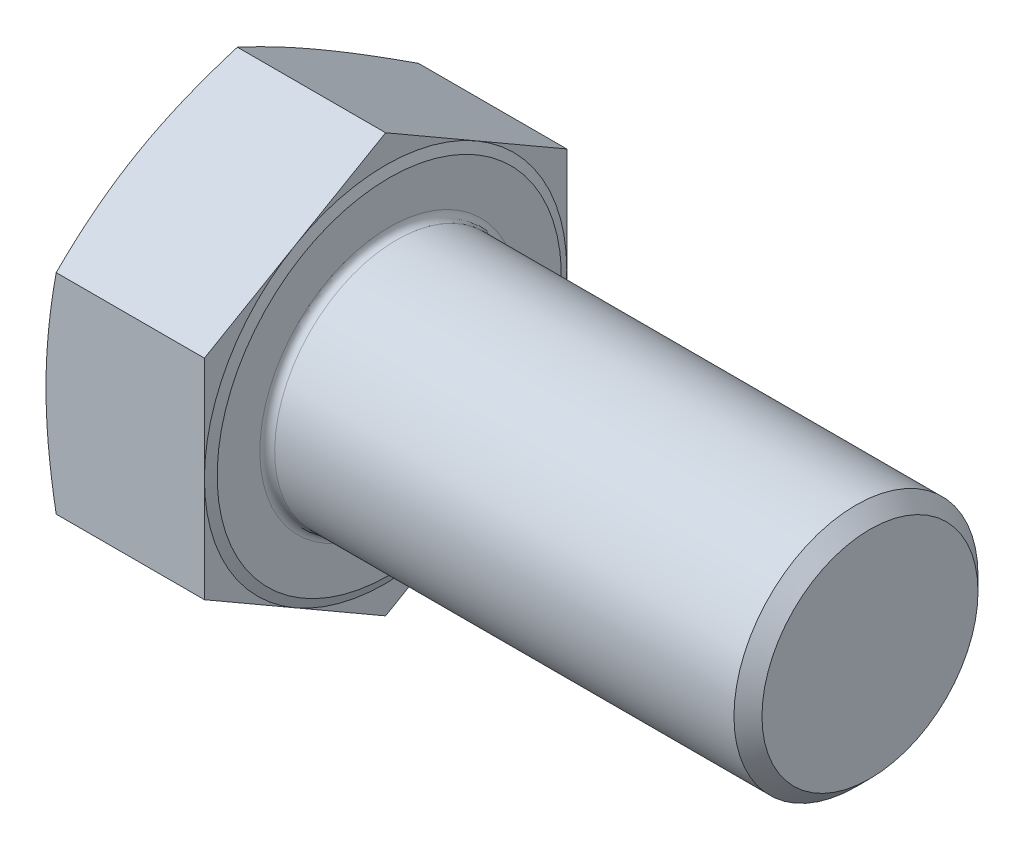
from build123d import *

# Parameters (mm, degrees)
BASEHEAD_DEPTH = 21.42
SKETCH3_R      = 16.5
BASEBODY_DEPTH = 65
CHAMFER1_SIZE  = 1.8945
HEADFILLET_R   = 1


with BuildPart() as part:
    # Sketch-BaseHead → BaseHead (new body)
    with BuildSketch(Plane(origin=(0, 0, 0), x_dir=(0, 0, -1), z_dir=(1, 0, 0))):
        Polygon((0, -28.29016319), (24.5, -14.145081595), (24.5, 14.145081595), (0, 28.29016319), (-24.5, 14.145081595), (-24.5, -14.145081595), align=None)
    extrude(amount=BASEHEAD_DEPTH)

    # Sketch4 → HeadChamfer (revolve, cut)
    with BuildSketch(Plane(origin=(-0.264637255, -5.916896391, 0), x_dir=(0, 1, 0), z_dir=(0, 0, 1))):
        Polygon((34.207059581, -0.264637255), (30.416896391, -0.264637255), (34.207059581, -1.64414384), align=None)
    revolve(axis=Axis((-4.001564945, 0, 0), (1, 0, 0)), mode=Mode.SUBTRACT)

    # Sketch1 → Revolve1 (revolve)
    with BuildSketch(Plane(origin=(0, 0, 0), x_dir=(1, 0, 0), z_dir=(0, 1, 0)), mode=Mode.PRIVATE) as revolve1_sk:
        Polygon((21.42, 0), (21.92, 0), (21.92, 23.275), (21.42, 24.5), align=None)
    revolve(revolve1_sk.sketch.rotate(Axis((-4.001564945, 0, 0), (1, 0, 0)), 270), axis=Axis((-4.001564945, 0, 0), (1, 0, 0)))

    # Sketch3 → BaseBody (add)
    with BuildSketch(Plane(origin=(21.92, 0, 0), x_dir=(0, 0, -1), z_dir=(1, 0, 0))):
        with Locations(Location((0, 0, 0), (0, 0, 270))):
            Circle(SKETCH3_R)
    extrude(amount=BASEBODY_DEPTH)

    # Chamfer1
    chamfer1_edges = [part.edges().sort_by_distance(p)[0] for p in [
        (86.92, 16.5, 0),
    ]]
    chamfer(chamfer1_edges, length=CHAMFER1_SIZE)

    # HeadFillet
    headfillet_edges = [part.edges().sort_by_distance(p)[0] for p in [
        (21.92, 16.5, 0),
    ]]
    fillet(headfillet_edges, radius=HEADFILLET_R)


solid = part.part
